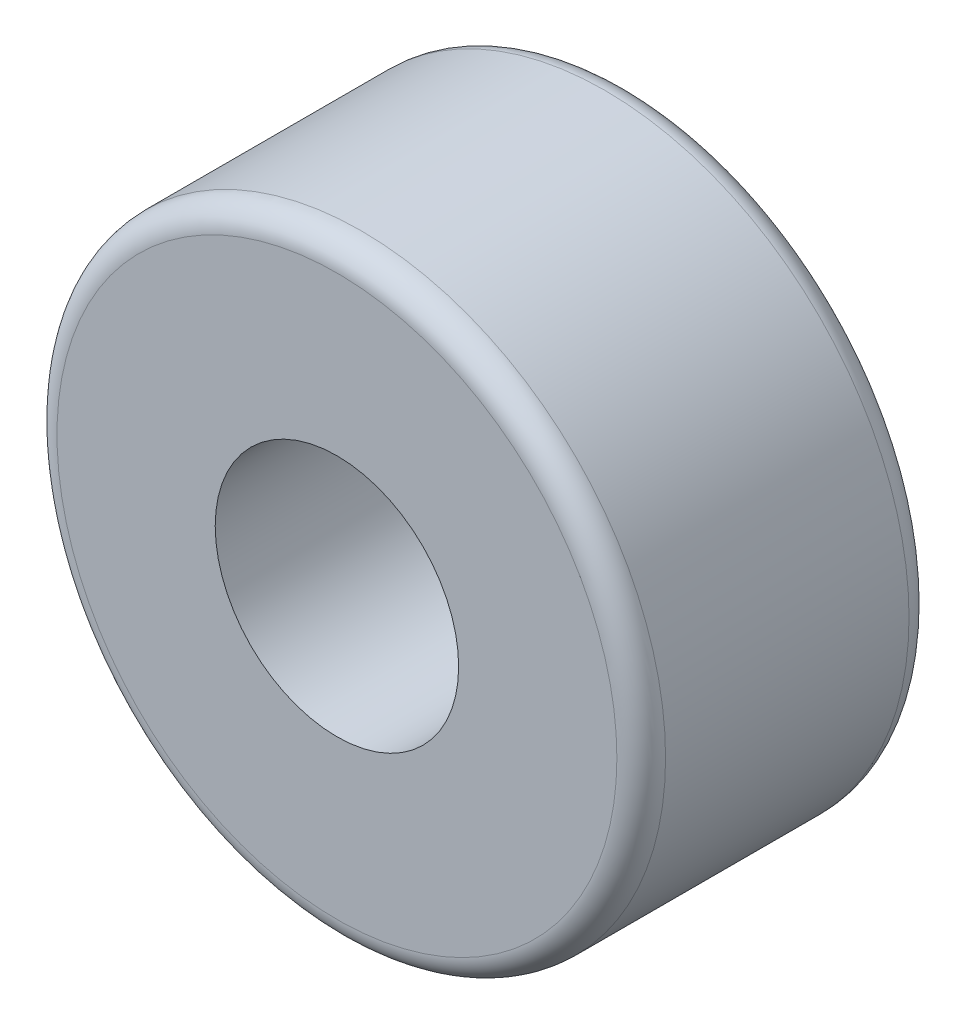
ISO-10303-21;
HEADER;
FILE_DESCRIPTION(('STEP AP214'),'2;1');
FILE_NAME('part.step','',(''),(''),'','','');
FILE_SCHEMA(('AUTOMOTIVE_DESIGN { 1 0 10303 214 1 1 1 1 }'));
ENDSEC;
DATA;
#1=APPLICATION_CONTEXT('core data for automotive mechanical design processes');
#2=APPLICATION_PROTOCOL_DEFINITION('international standard','automotive_design',2000,#1);
#3=PRODUCT_CONTEXT('',#1,'mechanical');
#4=PRODUCT('Part','Part','',(#3));
#5=PRODUCT_RELATED_PRODUCT_CATEGORY('part','',(#4));
#6=PRODUCT_DEFINITION_FORMATION('','',#4);
#7=PRODUCT_DEFINITION_CONTEXT('part definition',#1,'design');
#8=PRODUCT_DEFINITION('design','',#6,#7);
#9=PRODUCT_DEFINITION_SHAPE('','',#8);
#10=(LENGTH_UNIT() NAMED_UNIT(*) SI_UNIT(.MILLI.,.METRE.));
#11=(NAMED_UNIT(*) PLANE_ANGLE_UNIT() SI_UNIT($,.RADIAN.));
#12=(NAMED_UNIT(*) SI_UNIT($,.STERADIAN.) SOLID_ANGLE_UNIT());
#13=UNCERTAINTY_MEASURE_WITH_UNIT(LENGTH_MEASURE(1.E-05),#10,'distance_accuracy_value','');
#14=(GEOMETRIC_REPRESENTATION_CONTEXT(3) GLOBAL_UNCERTAINTY_ASSIGNED_CONTEXT((#13)) GLOBAL_UNIT_ASSIGNED_CONTEXT((#10,
#11,#12)) REPRESENTATION_CONTEXT('',''));
#15=CARTESIAN_POINT('',(0.,0.,0.));
#16=DIRECTION('',(0.,0.,1.));
#17=DIRECTION('',(1.,0.,0.));
#18=AXIS2_PLACEMENT_3D('',#15,#16,#17);
#19=CARTESIAN_POINT('',(0.,0.,1.));
#20=DIRECTION('',(0.,0.,1.));
#21=DIRECTION('',(1.,0.,0.));
#22=AXIS2_PLACEMENT_3D('',#19,#20,#21);
#23=TOROIDAL_SURFACE('',#22,11.5,1.);
#24=CARTESIAN_POINT('',(0.,0.,0.));
#25=DIRECTION('',(0.,0.,1.));
#26=DIRECTION('',(1.,0.,0.));
#27=AXIS2_PLACEMENT_3D('',#24,#25,#26);
#28=CIRCLE('',#27,11.5);
#29=CARTESIAN_POINT('',(11.5,0.,0.));
#30=VERTEX_POINT('',#29);
#31=EDGE_CURVE('E8',#30,#30,#28,.T.);
#32=ORIENTED_EDGE('',*,*,#31,.T.);
#33=EDGE_LOOP('',(#32));
#34=FACE_BOUND('',#33,.T.);
#35=CARTESIAN_POINT('',(0.,0.,1.));
#36=DIRECTION('',(0.,0.,1.));
#37=DIRECTION('',(1.,0.,0.));
#38=AXIS2_PLACEMENT_3D('',#35,#36,#37);
#39=CIRCLE('',#38,12.5);
#40=CARTESIAN_POINT('',(12.5,0.,1.));
#41=VERTEX_POINT('',#40);
#42=EDGE_CURVE('E34',#41,#41,#39,.T.);
#43=ORIENTED_EDGE('',*,*,#42,.F.);
#44=EDGE_LOOP('',(#43));
#45=FACE_BOUND('',#44,.T.);
#46=ADVANCED_FACE('F12',(#34,#45),#23,.T.);
#47=CARTESIAN_POINT('',(0.,-11.5,0.));
#48=DIRECTION('',(0.,0.,-1.));
#49=DIRECTION('',(-1.,0.,0.));
#50=AXIS2_PLACEMENT_3D('',#47,#48,#49);
#51=PLANE('',#50);
#52=CARTESIAN_POINT('',(0.,0.,0.));
#53=DIRECTION('',(0.,0.,1.));
#54=DIRECTION('',(1.,0.,0.));
#55=AXIS2_PLACEMENT_3D('',#52,#53,#54);
#56=CIRCLE('',#55,5.);
#57=CARTESIAN_POINT('',(5.,0.,0.));
#58=VERTEX_POINT('',#57);
#59=EDGE_CURVE('E18',#58,#58,#56,.T.);
#60=ORIENTED_EDGE('',*,*,#59,.T.);
#61=EDGE_LOOP('',(#60));
#62=FACE_BOUND('',#61,.T.);
#63=ORIENTED_EDGE('',*,*,#31,.F.);
#64=EDGE_LOOP('',(#63));
#65=FACE_BOUND('',#64,.T.);
#66=ADVANCED_FACE('F42',(#62,#65),#51,.T.);
#67=CARTESIAN_POINT('',(0.,0.,26.1502506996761));
#68=DIRECTION('',(0.,0.,1.));
#69=DIRECTION('',(1.,0.,0.));
#70=AXIS2_PLACEMENT_3D('',#67,#68,#69);
#71=CYLINDRICAL_SURFACE('',#70,5.);
#72=ORIENTED_EDGE('',*,*,#59,.F.);
#73=EDGE_LOOP('',(#72));
#74=FACE_BOUND('',#73,.T.);
#75=CARTESIAN_POINT('',(0.,0.,12.));
#76=DIRECTION('',(0.,0.,1.));
#77=DIRECTION('',(1.,0.,0.));
#78=AXIS2_PLACEMENT_3D('',#75,#76,#77);
#79=CIRCLE('',#78,5.);
#80=CARTESIAN_POINT('',(5.,0.,12.));
#81=VERTEX_POINT('',#80);
#82=EDGE_CURVE('E22',#81,#81,#79,.T.);
#83=ORIENTED_EDGE('',*,*,#82,.T.);
#84=EDGE_LOOP('',(#83));
#85=FACE_BOUND('',#84,.T.);
#86=ADVANCED_FACE('F48',(#74,#85),#71,.F.);
#87=CARTESIAN_POINT('',(0.,-5.,12.));
#88=DIRECTION('',(0.,0.,1.));
#89=DIRECTION('',(1.,0.,0.));
#90=AXIS2_PLACEMENT_3D('',#87,#88,#89);
#91=PLANE('',#90);
#92=CARTESIAN_POINT('',(0.,0.,12.));
#93=DIRECTION('',(0.,0.,1.));
#94=DIRECTION('',(1.,0.,0.));
#95=AXIS2_PLACEMENT_3D('',#92,#93,#94);
#96=CIRCLE('',#95,11.5);
#97=CARTESIAN_POINT('',(11.5,0.,12.));
#98=VERTEX_POINT('',#97);
#99=EDGE_CURVE('E26',#98,#98,#96,.T.);
#100=ORIENTED_EDGE('',*,*,#99,.T.);
#101=EDGE_LOOP('',(#100));
#102=FACE_BOUND('',#101,.T.);
#103=ORIENTED_EDGE('',*,*,#82,.F.);
#104=EDGE_LOOP('',(#103));
#105=FACE_BOUND('',#104,.T.);
#106=ADVANCED_FACE('F53',(#102,#105),#91,.T.);
#107=CARTESIAN_POINT('',(0.,0.,11.));
#108=DIRECTION('',(0.,0.,1.));
#109=DIRECTION('',(1.,0.,0.));
#110=AXIS2_PLACEMENT_3D('',#107,#108,#109);
#111=TOROIDAL_SURFACE('',#110,11.5,1.);
#112=CARTESIAN_POINT('',(0.,0.,11.));
#113=DIRECTION('',(0.,0.,1.));
#114=DIRECTION('',(1.,0.,0.));
#115=AXIS2_PLACEMENT_3D('',#112,#113,#114);
#116=CIRCLE('',#115,12.5);
#117=CARTESIAN_POINT('',(12.5,0.,11.));
#118=VERTEX_POINT('',#117);
#119=EDGE_CURVE('E31',#118,#118,#116,.T.);
#120=ORIENTED_EDGE('',*,*,#119,.T.);
#121=EDGE_LOOP('',(#120));
#122=FACE_BOUND('',#121,.T.);
#123=ORIENTED_EDGE('',*,*,#99,.F.);
#124=EDGE_LOOP('',(#123));
#125=FACE_BOUND('',#124,.T.);
#126=ADVANCED_FACE('F60',(#122,#125),#111,.T.);
#127=CARTESIAN_POINT('',(0.,0.,26.1502506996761));
#128=DIRECTION('',(0.,0.,1.));
#129=DIRECTION('',(1.,0.,0.));
#130=AXIS2_PLACEMENT_3D('',#127,#128,#129);
#131=CYLINDRICAL_SURFACE('',#130,12.5);
#132=ORIENTED_EDGE('',*,*,#42,.T.);
#133=EDGE_LOOP('',(#132));
#134=FACE_BOUND('',#133,.T.);
#135=ORIENTED_EDGE('',*,*,#119,.F.);
#136=EDGE_LOOP('',(#135));
#137=FACE_BOUND('',#136,.T.);
#138=ADVANCED_FACE('F38',(#134,#137),#131,.T.);
#139=CLOSED_SHELL('',(#46,#66,#86,#106,#126,#138));
#140=MANIFOLD_SOLID_BREP('B1',#139);
#141=ADVANCED_BREP_SHAPE_REPRESENTATION('',(#18,#140),#14);
#142=SHAPE_DEFINITION_REPRESENTATION(#9,#141);
ENDSEC;
END-ISO-10303-21;
